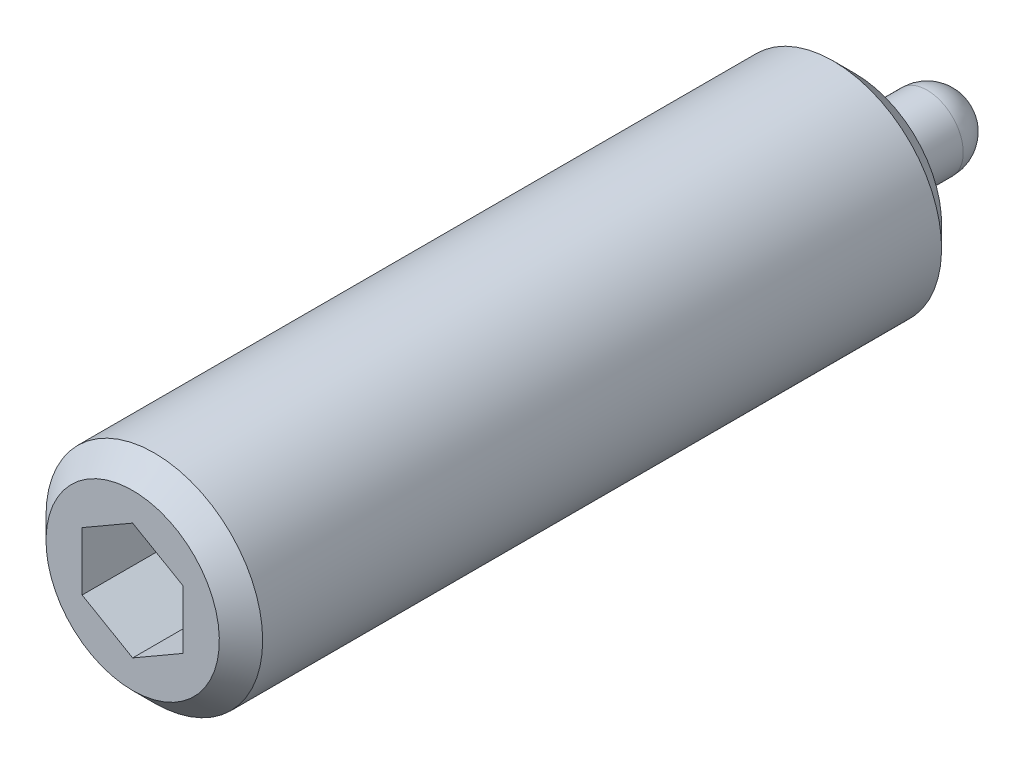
ISO-10303-21;
HEADER;
FILE_DESCRIPTION(('STEP AP214'),'2;1');
FILE_NAME('part.step','',(''),(''),'','','');
FILE_SCHEMA(('AUTOMOTIVE_DESIGN { 1 0 10303 214 1 1 1 1 }'));
ENDSEC;
DATA;
#1=APPLICATION_CONTEXT('core data for automotive mechanical design processes');
#2=APPLICATION_PROTOCOL_DEFINITION('international standard','automotive_design',2000,#1);
#3=PRODUCT_CONTEXT('',#1,'mechanical');
#4=PRODUCT('Part','Part','',(#3));
#5=PRODUCT_RELATED_PRODUCT_CATEGORY('part','',(#4));
#6=PRODUCT_DEFINITION_FORMATION('','',#4);
#7=PRODUCT_DEFINITION_CONTEXT('part definition',#1,'design');
#8=PRODUCT_DEFINITION('design','',#6,#7);
#9=PRODUCT_DEFINITION_SHAPE('','',#8);
#10=(LENGTH_UNIT() NAMED_UNIT(*) SI_UNIT(.MILLI.,.METRE.));
#11=(NAMED_UNIT(*) PLANE_ANGLE_UNIT() SI_UNIT($,.RADIAN.));
#12=(NAMED_UNIT(*) SI_UNIT($,.STERADIAN.) SOLID_ANGLE_UNIT());
#13=UNCERTAINTY_MEASURE_WITH_UNIT(LENGTH_MEASURE(1.E-05),#10,'distance_accuracy_value','');
#14=(GEOMETRIC_REPRESENTATION_CONTEXT(3) GLOBAL_UNCERTAINTY_ASSIGNED_CONTEXT((#13)) GLOBAL_UNIT_ASSIGNED_CONTEXT((#10,
#11,#12)) REPRESENTATION_CONTEXT('',''));
#15=CARTESIAN_POINT('',(0.,0.,0.));
#16=DIRECTION('',(0.,0.,1.));
#17=DIRECTION('',(1.,0.,0.));
#18=AXIS2_PLACEMENT_3D('',#15,#16,#17);
#19=CARTESIAN_POINT('',(0.,1.5,11.5));
#20=DIRECTION('',(0.,0.,1.));
#21=DIRECTION('',(1.,0.,0.));
#22=AXIS2_PLACEMENT_3D('',#19,#20,#21);
#23=PLANE('',#22);
#24=CARTESIAN_POINT('',(0.,0.,11.5));
#25=DIRECTION('',(0.,0.,1.));
#26=DIRECTION('',(0.,-1.,0.));
#27=AXIS2_PLACEMENT_3D('',#24,#25,#26);
#28=CIRCLE('',#27,1.2);
#29=CARTESIAN_POINT('',(0.,-1.2,11.5));
#30=VERTEX_POINT('',#29);
#31=EDGE_CURVE('E9',#30,#30,#28,.T.);
#32=ORIENTED_EDGE('',*,*,#31,.T.);
#33=EDGE_LOOP('',(#32));
#34=FACE_BOUND('',#33,.T.);
#35=DIRECTION('',(0.866025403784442,-0.5,0.));
#36=VECTOR('',#35,1.);
#37=CARTESIAN_POINT('',(-0.7,-0.404145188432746,11.5));
#38=LINE('',#37,#36);
#39=CARTESIAN_POINT('',(-0.7,-0.404145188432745,11.5));
#40=VERTEX_POINT('',#39);
#41=CARTESIAN_POINT('',(0.,-0.808290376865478,11.5));
#42=VERTEX_POINT('',#41);
#43=EDGE_CURVE('E84',#40,#42,#38,.T.);
#44=ORIENTED_EDGE('',*,*,#43,.F.);
#45=DIRECTION('',(0.,1.,0.));
#46=VECTOR('',#45,1.);
#47=CARTESIAN_POINT('',(-0.7,-0.404145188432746,11.5));
#48=LINE('',#47,#46);
#49=CARTESIAN_POINT('',(-0.7,0.404145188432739,11.5));
#50=VERTEX_POINT('',#49);
#51=EDGE_CURVE('E29',#40,#50,#48,.T.);
#52=ORIENTED_EDGE('',*,*,#51,.T.);
#53=DIRECTION('',(0.866025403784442,0.5,0.));
#54=VECTOR('',#53,1.);
#55=CARTESIAN_POINT('',(-0.7,0.404145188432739,11.5));
#56=LINE('',#55,#54);
#57=CARTESIAN_POINT('',(0.,0.808290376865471,11.5));
#58=VERTEX_POINT('',#57);
#59=EDGE_CURVE('E74',#50,#58,#56,.T.);
#60=ORIENTED_EDGE('',*,*,#59,.T.);
#61=DIRECTION('',(-0.866025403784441,0.5,0.));
#62=VECTOR('',#61,1.);
#63=CARTESIAN_POINT('',(0.7,0.404145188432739,11.5));
#64=LINE('',#63,#62);
#65=CARTESIAN_POINT('',(0.7,0.404145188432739,11.5));
#66=VERTEX_POINT('',#65);
#67=EDGE_CURVE('E79',#66,#58,#64,.T.);
#68=ORIENTED_EDGE('',*,*,#67,.F.);
#69=DIRECTION('',(0.,1.,0.));
#70=VECTOR('',#69,1.);
#71=CARTESIAN_POINT('',(0.7,-0.404145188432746,11.5));
#72=LINE('',#71,#70);
#73=CARTESIAN_POINT('',(0.7,-0.404145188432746,11.5));
#74=VERTEX_POINT('',#73);
#75=EDGE_CURVE('E88',#74,#66,#72,.T.);
#76=ORIENTED_EDGE('',*,*,#75,.F.);
#77=DIRECTION('',(-0.866025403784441,-0.5,0.));
#78=VECTOR('',#77,1.);
#79=CARTESIAN_POINT('',(0.7,-0.404145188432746,11.5));
#80=LINE('',#79,#78);
#81=EDGE_CURVE('E91',#74,#42,#80,.T.);
#82=ORIENTED_EDGE('',*,*,#81,.T.);
#83=EDGE_LOOP('',(#44,#52,#60,#68,#76,#82));
#84=FACE_BOUND('',#83,.T.);
#85=ADVANCED_FACE('F14',(#34,#84),#23,.T.);
#86=CARTESIAN_POINT('',(0.,0.,0.5));
#87=DIRECTION('',(-1.,0.,0.));
#88=DIRECTION('',(0.,0.,1.));
#89=AXIS2_PLACEMENT_3D('',#86,#87,#88);
#90=SPHERICAL_SURFACE('',#89,0.5);
#91=CARTESIAN_POINT('',(0.,0.,0.5));
#92=DIRECTION('',(0.,0.,-1.));
#93=DIRECTION('',(-1.,0.,0.));
#94=AXIS2_PLACEMENT_3D('',#91,#92,#93);
#95=SPHERICAL_SURFACE('',#94,0.5);
#96=CARTESIAN_POINT('',(0.,0.,0.5));
#97=DIRECTION('',(0.,0.,-1.));
#98=DIRECTION('',(-1.,0.,0.));
#99=AXIS2_PLACEMENT_3D('',#96,#97,#98);
#100=CIRCLE('',#99,0.5);
#101=CARTESIAN_POINT('',(-0.5,0.,0.5));
#102=VERTEX_POINT('',#101);
#103=EDGE_CURVE('E70',#102,#102,#100,.T.);
#104=ORIENTED_EDGE('',*,*,#103,.T.);
#105=EDGE_LOOP('',(#104));
#106=FACE_BOUND('',#105,.T.);
#107=ADVANCED_FACE('F152',(#106),#95,.T.);
#108=CARTESIAN_POINT('',(0.,0.,-8.5));
#109=DIRECTION('',(0.,0.,-1.));
#110=DIRECTION('',(-1.,0.,0.));
#111=AXIS2_PLACEMENT_3D('',#108,#109,#110);
#112=CYLINDRICAL_SURFACE('',#111,1.5);
#113=CARTESIAN_POINT('',(0.,0.,1.8));
#114=DIRECTION('',(0.,0.,-1.));
#115=DIRECTION('',(0.,1.,0.));
#116=AXIS2_PLACEMENT_3D('',#113,#114,#115);
#117=CIRCLE('',#116,1.5);
#118=CARTESIAN_POINT('',(0.,1.5,1.8));
#119=VERTEX_POINT('',#118);
#120=EDGE_CURVE('E22',#119,#119,#117,.F.);
#121=ORIENTED_EDGE('',*,*,#120,.T.);
#122=EDGE_LOOP('',(#121));
#123=FACE_BOUND('',#122,.T.);
#124=CARTESIAN_POINT('',(0.,0.,11.2));
#125=DIRECTION('',(0.,0.,1.));
#126=DIRECTION('',(0.,-1.,0.));
#127=AXIS2_PLACEMENT_3D('',#124,#125,#126);
#128=CIRCLE('',#127,1.5);
#129=CARTESIAN_POINT('',(0.,-1.5,11.2));
#130=VERTEX_POINT('',#129);
#131=EDGE_CURVE('E125',#130,#130,#128,.F.);
#132=ORIENTED_EDGE('',*,*,#131,.T.);
#133=EDGE_LOOP('',(#132));
#134=FACE_BOUND('',#133,.T.);
#135=ADVANCED_FACE('F130',(#123,#134),#112,.T.);
#136=CARTESIAN_POINT('',(0.,0.5,1.5));
#137=DIRECTION('',(0.,0.,-1.));
#138=DIRECTION('',(-1.,0.,0.));
#139=AXIS2_PLACEMENT_3D('',#136,#137,#138);
#140=PLANE('',#139);
#141=CARTESIAN_POINT('',(0.,0.,1.5));
#142=DIRECTION('',(0.,0.,-1.));
#143=DIRECTION('',(0.,1.,0.));
#144=AXIS2_PLACEMENT_3D('',#141,#142,#143);
#145=CIRCLE('',#144,1.2);
#146=CARTESIAN_POINT('',(0.,1.2,1.5));
#147=VERTEX_POINT('',#146);
#148=EDGE_CURVE('E122',#147,#147,#145,.T.);
#149=ORIENTED_EDGE('',*,*,#148,.T.);
#150=EDGE_LOOP('',(#149));
#151=FACE_BOUND('',#150,.T.);
#152=CARTESIAN_POINT('',(0.,0.,1.5));
#153=DIRECTION('',(0.,0.,-1.));
#154=DIRECTION('',(-1.,0.,0.));
#155=AXIS2_PLACEMENT_3D('',#152,#153,#154);
#156=CIRCLE('',#155,0.5);
#157=CARTESIAN_POINT('',(-0.5,0.,1.5));
#158=VERTEX_POINT('',#157);
#159=EDGE_CURVE('E119',#158,#158,#156,.T.);
#160=ORIENTED_EDGE('',*,*,#159,.F.);
#161=EDGE_LOOP('',(#160));
#162=FACE_BOUND('',#161,.T.);
#163=ADVANCED_FACE('F140',(#151,#162),#140,.T.);
#164=CARTESIAN_POINT('',(0.,0.,-8.5));
#165=DIRECTION('',(0.,0.,-1.));
#166=DIRECTION('',(-1.,0.,0.));
#167=AXIS2_PLACEMENT_3D('',#164,#165,#166);
#168=CYLINDRICAL_SURFACE('',#167,0.5);
#169=ORIENTED_EDGE('',*,*,#159,.T.);
#170=EDGE_LOOP('',(#169));
#171=FACE_BOUND('',#170,.T.);
#172=ORIENTED_EDGE('',*,*,#103,.F.);
#173=EDGE_LOOP('',(#172));
#174=FACE_BOUND('',#173,.T.);
#175=ADVANCED_FACE('F143',(#171,#174),#168,.T.);
#176=CARTESIAN_POINT('',(-0.7,-0.404145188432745,10.));
#177=DIRECTION('',(1.,0.,0.));
#178=DIRECTION('',(0.,0.,-1.));
#179=AXIS2_PLACEMENT_3D('',#176,#177,#178);
#180=PLANE('',#179);
#181=DIRECTION('',(0.,0.,1.));
#182=VECTOR('',#181,1.);
#183=CARTESIAN_POINT('',(-0.7,0.40414518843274,10.));
#184=LINE('',#183,#182);
#185=CARTESIAN_POINT('',(-0.7,0.40414518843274,10.));
#186=VERTEX_POINT('',#185);
#187=EDGE_CURVE('E63',#186,#50,#184,.T.);
#188=ORIENTED_EDGE('',*,*,#187,.T.);
#189=ORIENTED_EDGE('',*,*,#51,.F.);
#190=DIRECTION('',(0.,0.,1.));
#191=VECTOR('',#190,1.);
#192=CARTESIAN_POINT('',(-0.7,-0.404145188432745,10.));
#193=LINE('',#192,#191);
#194=CARTESIAN_POINT('',(-0.7,-0.404145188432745,10.));
#195=VERTEX_POINT('',#194);
#196=EDGE_CURVE('E33',#195,#40,#193,.T.);
#197=ORIENTED_EDGE('',*,*,#196,.F.);
#198=DIRECTION('',(0.,1.,0.));
#199=VECTOR('',#198,1.);
#200=CARTESIAN_POINT('',(-0.7,-0.404145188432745,10.));
#201=LINE('',#200,#199);
#202=EDGE_CURVE('E66',#195,#186,#201,.T.);
#203=ORIENTED_EDGE('',*,*,#202,.T.);
#204=EDGE_LOOP('',(#188,#189,#197,#203));
#205=FACE_BOUND('',#204,.T.);
#206=ADVANCED_FACE('F65',(#205),#180,.T.);
#207=CARTESIAN_POINT('',(-0.7,0.40414518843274,10.));
#208=DIRECTION('',(0.5,-0.866025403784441,0.));
#209=DIRECTION('',(0.866025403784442,0.5,0.));
#210=AXIS2_PLACEMENT_3D('',#207,#208,#209);
#211=PLANE('',#210);
#212=DIRECTION('',(0.,0.,1.));
#213=VECTOR('',#212,1.);
#214=CARTESIAN_POINT('',(0.,0.808290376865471,10.));
#215=LINE('',#214,#213);
#216=CARTESIAN_POINT('',(0.,0.808290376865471,10.));
#217=VERTEX_POINT('',#216);
#218=EDGE_CURVE('E71',#217,#58,#215,.T.);
#219=ORIENTED_EDGE('',*,*,#218,.T.);
#220=ORIENTED_EDGE('',*,*,#59,.F.);
#221=ORIENTED_EDGE('',*,*,#187,.F.);
#222=DIRECTION('',(0.866025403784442,0.5,0.));
#223=VECTOR('',#222,1.);
#224=CARTESIAN_POINT('',(-0.7,0.40414518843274,10.));
#225=LINE('',#224,#223);
#226=EDGE_CURVE('E95',#186,#217,#225,.T.);
#227=ORIENTED_EDGE('',*,*,#226,.T.);
#228=EDGE_LOOP('',(#219,#220,#221,#227));
#229=FACE_BOUND('',#228,.T.);
#230=ADVANCED_FACE('F75',(#229),#211,.T.);
#231=CARTESIAN_POINT('',(0.7,0.40414518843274,10.));
#232=DIRECTION('',(0.5,0.866025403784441,0.));
#233=DIRECTION('',(-0.866025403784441,0.5,0.));
#234=AXIS2_PLACEMENT_3D('',#231,#232,#233);
#235=PLANE('',#234);
#236=DIRECTION('',(0.,0.,1.));
#237=VECTOR('',#236,1.);
#238=CARTESIAN_POINT('',(0.7,0.40414518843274,10.));
#239=LINE('',#238,#237);
#240=CARTESIAN_POINT('',(0.7,0.40414518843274,10.));
#241=VERTEX_POINT('',#240);
#242=EDGE_CURVE('E114',#241,#66,#239,.T.);
#243=ORIENTED_EDGE('',*,*,#242,.T.);
#244=ORIENTED_EDGE('',*,*,#67,.T.);
#245=ORIENTED_EDGE('',*,*,#218,.F.);
#246=DIRECTION('',(-0.866025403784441,0.5,0.));
#247=VECTOR('',#246,1.);
#248=CARTESIAN_POINT('',(0.7,0.40414518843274,10.));
#249=LINE('',#248,#247);
#250=EDGE_CURVE('E97',#241,#217,#249,.T.);
#251=ORIENTED_EDGE('',*,*,#250,.F.);
#252=EDGE_LOOP('',(#243,#244,#245,#251));
#253=FACE_BOUND('',#252,.T.);
#254=ADVANCED_FACE('F167',(#253),#235,.F.);
#255=CARTESIAN_POINT('',(0.7,-0.404145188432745,10.));
#256=DIRECTION('',(1.,0.,0.));
#257=DIRECTION('',(0.,0.,-1.));
#258=AXIS2_PLACEMENT_3D('',#255,#256,#257);
#259=PLANE('',#258);
#260=DIRECTION('',(0.,0.,1.));
#261=VECTOR('',#260,1.);
#262=CARTESIAN_POINT('',(0.7,-0.404145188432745,10.));
#263=LINE('',#262,#261);
#264=CARTESIAN_POINT('',(0.7,-0.404145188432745,10.));
#265=VERTEX_POINT('',#264);
#266=EDGE_CURVE('E112',#265,#74,#263,.T.);
#267=ORIENTED_EDGE('',*,*,#266,.T.);
#268=ORIENTED_EDGE('',*,*,#75,.T.);
#269=ORIENTED_EDGE('',*,*,#242,.F.);
#270=DIRECTION('',(0.,1.,0.));
#271=VECTOR('',#270,1.);
#272=CARTESIAN_POINT('',(0.7,-0.404145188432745,10.));
#273=LINE('',#272,#271);
#274=EDGE_CURVE('E100',#265,#241,#273,.T.);
#275=ORIENTED_EDGE('',*,*,#274,.F.);
#276=EDGE_LOOP('',(#267,#268,#269,#275));
#277=FACE_BOUND('',#276,.T.);
#278=ADVANCED_FACE('F170',(#277),#259,.F.);
#279=CARTESIAN_POINT('',(0.7,-0.404145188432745,10.));
#280=DIRECTION('',(-0.5,0.866025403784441,0.));
#281=DIRECTION('',(-0.866025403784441,-0.5,0.));
#282=AXIS2_PLACEMENT_3D('',#279,#280,#281);
#283=PLANE('',#282);
#284=DIRECTION('',(0.,0.,1.));
#285=VECTOR('',#284,1.);
#286=CARTESIAN_POINT('',(0.,-0.808290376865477,10.));
#287=LINE('',#286,#285);
#288=CARTESIAN_POINT('',(0.,-0.808290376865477,10.));
#289=VERTEX_POINT('',#288);
#290=EDGE_CURVE('E110',#289,#42,#287,.T.);
#291=ORIENTED_EDGE('',*,*,#290,.T.);
#292=ORIENTED_EDGE('',*,*,#81,.F.);
#293=ORIENTED_EDGE('',*,*,#266,.F.);
#294=DIRECTION('',(-0.866025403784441,-0.5,0.));
#295=VECTOR('',#294,1.);
#296=CARTESIAN_POINT('',(0.7,-0.404145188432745,10.));
#297=LINE('',#296,#295);
#298=EDGE_CURVE('E103',#265,#289,#297,.T.);
#299=ORIENTED_EDGE('',*,*,#298,.T.);
#300=EDGE_LOOP('',(#291,#292,#293,#299));
#301=FACE_BOUND('',#300,.T.);
#302=ADVANCED_FACE('F174',(#301),#283,.T.);
#303=CARTESIAN_POINT('',(-0.7,-0.404145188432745,10.));
#304=DIRECTION('',(-0.5,-0.866025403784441,0.));
#305=DIRECTION('',(0.866025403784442,-0.5,0.));
#306=AXIS2_PLACEMENT_3D('',#303,#304,#305);
#307=PLANE('',#306);
#308=DIRECTION('',(0.866025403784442,-0.5,0.));
#309=VECTOR('',#308,1.);
#310=CARTESIAN_POINT('',(-0.7,-0.404145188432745,10.));
#311=LINE('',#310,#309);
#312=EDGE_CURVE('E106',#195,#289,#311,.T.);
#313=ORIENTED_EDGE('',*,*,#312,.F.);
#314=ORIENTED_EDGE('',*,*,#196,.T.);
#315=ORIENTED_EDGE('',*,*,#43,.T.);
#316=ORIENTED_EDGE('',*,*,#290,.F.);
#317=EDGE_LOOP('',(#313,#314,#315,#316));
#318=FACE_BOUND('',#317,.T.);
#319=ADVANCED_FACE('F137',(#318),#307,.F.);
#320=CARTESIAN_POINT('',(-0.7,0.40414518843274,10.));
#321=DIRECTION('',(0.,0.,-1.));
#322=DIRECTION('',(-1.,0.,0.));
#323=AXIS2_PLACEMENT_3D('',#320,#321,#322);
#324=PLANE('',#323);
#325=ORIENTED_EDGE('',*,*,#202,.F.);
#326=ORIENTED_EDGE('',*,*,#312,.T.);
#327=ORIENTED_EDGE('',*,*,#298,.F.);
#328=ORIENTED_EDGE('',*,*,#274,.T.);
#329=ORIENTED_EDGE('',*,*,#250,.T.);
#330=ORIENTED_EDGE('',*,*,#226,.F.);
#331=EDGE_LOOP('',(#325,#326,#327,#328,#329,#330));
#332=FACE_BOUND('',#331,.T.);
#333=ADVANCED_FACE('F136',(#332),#324,.F.);
#334=CARTESIAN_POINT('',(0.,0.,1.5));
#335=DIRECTION('',(0.,0.,1.));
#336=DIRECTION('',(0.,-1.,0.));
#337=AXIS2_PLACEMENT_3D('',#334,#335,#336);
#338=CONICAL_SURFACE('',#337,1.2,0.785398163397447);
#339=ORIENTED_EDGE('',*,*,#120,.F.);
#340=EDGE_LOOP('',(#339));
#341=FACE_BOUND('',#340,.T.);
#342=ORIENTED_EDGE('',*,*,#148,.F.);
#343=EDGE_LOOP('',(#342));
#344=FACE_BOUND('',#343,.T.);
#345=ADVANCED_FACE('F133',(#341,#344),#338,.T.);
#346=CARTESIAN_POINT('',(0.,0.,11.2));
#347=DIRECTION('',(0.,0.,-1.));
#348=DIRECTION('',(0.,1.,0.));
#349=AXIS2_PLACEMENT_3D('',#346,#347,#348);
#350=CONICAL_SURFACE('',#349,1.5,0.785398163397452);
#351=ORIENTED_EDGE('',*,*,#31,.F.);
#352=EDGE_LOOP('',(#351));
#353=FACE_BOUND('',#352,.T.);
#354=ORIENTED_EDGE('',*,*,#131,.F.);
#355=EDGE_LOOP('',(#354));
#356=FACE_BOUND('',#355,.T.);
#357=ADVANCED_FACE('F16',(#353,#356),#350,.T.);
#358=CLOSED_SHELL('',(#85,#107,#135,#163,#175,#206,#230,#254,#278,#302,#319,#333,#345,#357));
#359=MANIFOLD_SOLID_BREP('B1',#358);
#360=ADVANCED_BREP_SHAPE_REPRESENTATION('',(#18,#359),#14);
#361=SHAPE_DEFINITION_REPRESENTATION(#9,#360);
ENDSEC;
END-ISO-10303-21;
